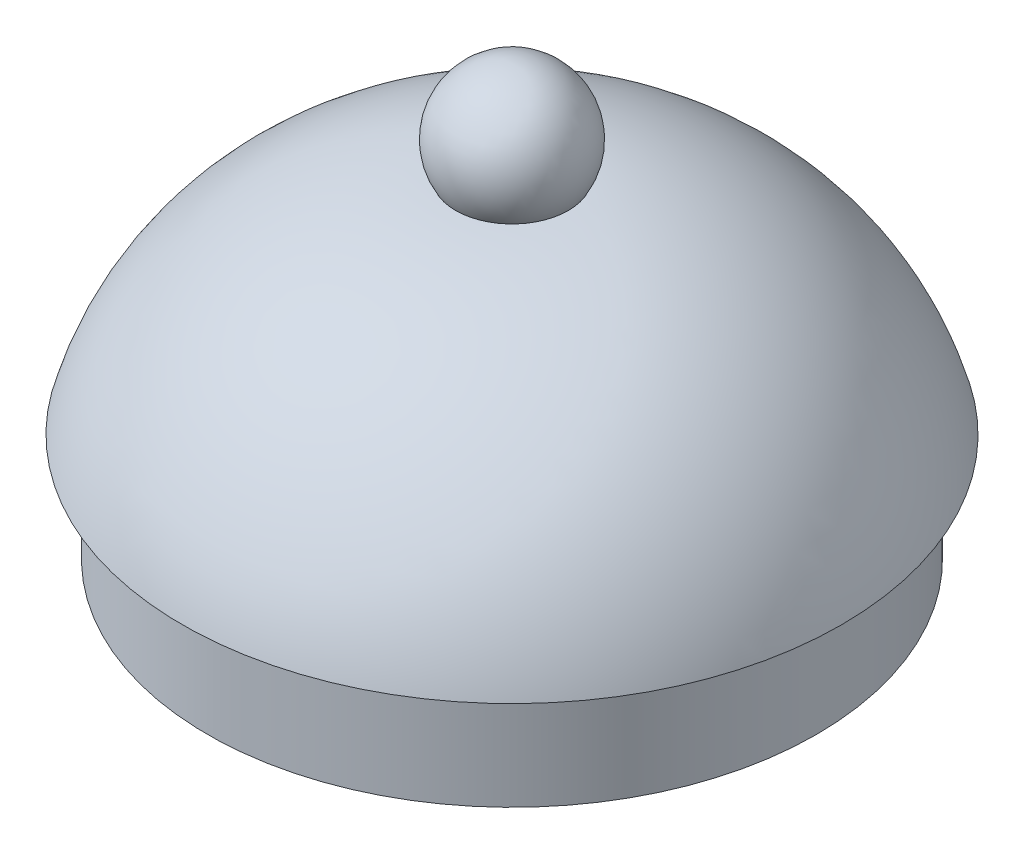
ISO-10303-21;
HEADER;
FILE_DESCRIPTION(('STEP AP214'),'2;1');
FILE_NAME('part.step','',(''),(''),'','','');
FILE_SCHEMA(('AUTOMOTIVE_DESIGN { 1 0 10303 214 1 1 1 1 }'));
ENDSEC;
DATA;
#1=APPLICATION_CONTEXT('core data for automotive mechanical design processes');
#2=APPLICATION_PROTOCOL_DEFINITION('international standard','automotive_design',2000,#1);
#3=PRODUCT_CONTEXT('',#1,'mechanical');
#4=PRODUCT('Part','Part','',(#3));
#5=PRODUCT_RELATED_PRODUCT_CATEGORY('part','',(#4));
#6=PRODUCT_DEFINITION_FORMATION('','',#4);
#7=PRODUCT_DEFINITION_CONTEXT('part definition',#1,'design');
#8=PRODUCT_DEFINITION('design','',#6,#7);
#9=PRODUCT_DEFINITION_SHAPE('','',#8);
#10=(LENGTH_UNIT() NAMED_UNIT(*) SI_UNIT(.MILLI.,.METRE.));
#11=(NAMED_UNIT(*) PLANE_ANGLE_UNIT() SI_UNIT($,.RADIAN.));
#12=(NAMED_UNIT(*) SI_UNIT($,.STERADIAN.) SOLID_ANGLE_UNIT());
#13=UNCERTAINTY_MEASURE_WITH_UNIT(LENGTH_MEASURE(1.E-05),#10,'distance_accuracy_value','');
#14=(GEOMETRIC_REPRESENTATION_CONTEXT(3) GLOBAL_UNCERTAINTY_ASSIGNED_CONTEXT((#13)) GLOBAL_UNIT_ASSIGNED_CONTEXT((#10,
#11,#12)) REPRESENTATION_CONTEXT('',''));
#15=CARTESIAN_POINT('',(0.,0.,0.));
#16=DIRECTION('',(0.,0.,1.));
#17=DIRECTION('',(1.,0.,0.));
#18=AXIS2_PLACEMENT_3D('',#15,#16,#17);
#19=CARTESIAN_POINT('',(0.,24.0362954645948,0.));
#20=DIRECTION('',(0.,1.,0.));
#21=DIRECTION('',(-1.,0.,0.));
#22=AXIS2_PLACEMENT_3D('',#19,#20,#21);
#23=DEGENERATE_TOROIDAL_SURFACE('',#22,31.6467172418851,240.,.T.);
#24=CARTESIAN_POINT('',(0.,263.660572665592,0.));
#25=DIRECTION('',(0.,1.,0.));
#26=DIRECTION('',(-1.,0.,0.));
#27=AXIS2_PLACEMENT_3D('',#24,#25,#26);
#28=CIRCLE('',#27,45.0707917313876);
#29=CARTESIAN_POINT('',(-45.0707917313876,263.660572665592,0.));
#30=VERTEX_POINT('',#29);
#31=EDGE_CURVE('E51',#30,#30,#28,.T.);
#32=ORIENTED_EDGE('',*,*,#31,.F.);
#33=EDGE_LOOP('',(#32));
#34=FACE_BOUND('',#33,.T.);
#35=CARTESIAN_POINT('',(0.,86.,0.));
#36=DIRECTION('',(0.,1.,0.));
#37=DIRECTION('',(-1.,0.,0.));
#38=AXIS2_PLACEMENT_3D('',#35,#36,#37);
#39=CIRCLE('',#38,263.50982194);
#40=CARTESIAN_POINT('',(-263.50982194,86.,0.));
#41=VERTEX_POINT('',#40);
#42=EDGE_CURVE('E78',#41,#41,#39,.T.);
#43=ORIENTED_EDGE('',*,*,#42,.T.);
#44=EDGE_LOOP('',(#43));
#45=FACE_BOUND('',#44,.T.);
#46=ADVANCED_FACE('F43',(#34,#45),#23,.T.);
#47=CARTESIAN_POINT('',(0.,0.,0.));
#48=DIRECTION('',(0.,1.,0.));
#49=DIRECTION('',(-1.,0.,0.));
#50=AXIS2_PLACEMENT_3D('',#47,#48,#49);
#51=PLANE('',#50);
#52=CARTESIAN_POINT('',(0.,0.,0.));
#53=DIRECTION('',(0.,1.,0.));
#54=DIRECTION('',(-1.,0.,0.));
#55=AXIS2_PLACEMENT_3D('',#52,#53,#54);
#56=CIRCLE('',#55,243.44982194);
#57=CARTESIAN_POINT('',(-243.44982194,0.,0.));
#58=VERTEX_POINT('',#57);
#59=EDGE_CURVE('E86',#58,#58,#56,.T.);
#60=ORIENTED_EDGE('',*,*,#59,.F.);
#61=EDGE_LOOP('',(#60));
#62=FACE_BOUND('',#61,.T.);
#63=ADVANCED_FACE('F66',(#62),#51,.F.);
#64=CARTESIAN_POINT('',(0.,261.940657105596,0.));
#65=DIRECTION('',(0.,1.,0.));
#66=DIRECTION('',(-1.,0.,0.));
#67=AXIS2_PLACEMENT_3D('',#64,#65,#66);
#68=CYLINDRICAL_SURFACE('',#67,243.44982194);
#69=CARTESIAN_POINT('',(0.,86.,0.));
#70=DIRECTION('',(0.,1.,0.));
#71=DIRECTION('',(-1.,0.,0.));
#72=AXIS2_PLACEMENT_3D('',#69,#70,#71);
#73=CIRCLE('',#72,243.44982194);
#74=CARTESIAN_POINT('',(-243.44982194,86.,0.));
#75=VERTEX_POINT('',#74);
#76=EDGE_CURVE('E81',#75,#75,#73,.T.);
#77=ORIENTED_EDGE('',*,*,#76,.F.);
#78=EDGE_LOOP('',(#77));
#79=FACE_BOUND('',#78,.T.);
#80=ORIENTED_EDGE('',*,*,#59,.T.);
#81=EDGE_LOOP('',(#80));
#82=FACE_BOUND('',#81,.T.);
#83=ADVANCED_FACE('F71',(#79,#82),#68,.T.);
#84=CARTESIAN_POINT('',(0.,86.,0.));
#85=DIRECTION('',(0.,-1.,0.));
#86=DIRECTION('',(1.,0.,0.));
#87=AXIS2_PLACEMENT_3D('',#84,#85,#86);
#88=PLANE('',#87);
#89=ORIENTED_EDGE('',*,*,#76,.T.);
#90=EDGE_LOOP('',(#89));
#91=FACE_BOUND('',#90,.T.);
#92=ORIENTED_EDGE('',*,*,#42,.F.);
#93=EDGE_LOOP('',(#92));
#94=FACE_BOUND('',#93,.T.);
#95=ADVANCED_FACE('F94',(#91,#94),#88,.T.);
#96=CARTESIAN_POINT('',(0.,290.413228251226,0.));
#97=DIRECTION('',(0.,-1.,0.));
#98=DIRECTION('',(1.,0.,0.));
#99=AXIS2_PLACEMENT_3D('',#96,#97,#98);
#100=SPHERICAL_SURFACE('',#99,52.4126019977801);
#101=ORIENTED_EDGE('',*,*,#31,.T.);
#102=EDGE_LOOP('',(#101));
#103=FACE_BOUND('',#102,.T.);
#104=ADVANCED_FACE('F92',(#103),#100,.T.);
#105=CLOSED_SHELL('',(#46,#63,#83,#95,#104));
#106=CARTESIAN_POINT('',(0.,263.660572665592,0.));
#107=DIRECTION('',(0.,-1.,0.));
#108=DIRECTION('',(0.,0.,-1.));
#109=AXIS2_PLACEMENT_3D('',#106,#107,#108);
#110=PLANE('',#109);
#111=CARTESIAN_POINT('',(0.,263.660572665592,0.));
#112=DIRECTION('',(0.,1.,0.));
#113=DIRECTION('',(0.,0.,1.));
#114=AXIS2_PLACEMENT_3D('',#111,#112,#113);
#115=CIRCLE('',#114,18.2226427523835);
#116=CARTESIAN_POINT('',(0.,263.660572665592,18.2226427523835));
#117=VERTEX_POINT('',#116);
#118=EDGE_CURVE('E11',#117,#117,#115,.F.);
#119=ORIENTED_EDGE('',*,*,#118,.T.);
#120=EDGE_LOOP('',(#119));
#121=FACE_BOUND('',#120,.T.);
#122=ADVANCED_FACE('F56',(#121),#110,.T.);
#123=CARTESIAN_POINT('',(-31.6467172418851,24.0362954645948,0.));
#124=DIRECTION('',(0.,0.,-1.));
#125=DIRECTION('',(-1.,0.,0.));
#126=AXIS2_PLACEMENT_3D('',#123,#124,#125);
#127=CIRCLE('',#126,240.);
#128=TRIMMED_CURVE('',#127,(PARAMETER_VALUE(-1.70304279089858)),
(PARAMETER_VALUE(1.70304279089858)),.T.,.PARAMETER.);
#129=CARTESIAN_POINT('',(0.,24.0362954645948,0.));
#130=DIRECTION('',(0.,1.,0.));
#131=AXIS1_PLACEMENT('',#129,#130);
#132=SURFACE_OF_REVOLUTION('',#128,#131);
#133=ORIENTED_EDGE('',*,*,#118,.F.);
#134=EDGE_LOOP('',(#133));
#135=FACE_BOUND('',#134,.T.);
#136=CARTESIAN_POINT('',(0.,261.940657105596,0.));
#137=VERTEX_POINT('',#136);
#138=VERTEX_LOOP('',#137);
#139=FACE_BOUND('',#138,.T.);
#140=ADVANCED_FACE('F54',(#135,#139),#132,.T.);
#141=CLOSED_SHELL('',(#122,#140));
#142=ORIENTED_CLOSED_SHELL('',*,#141,.T.);
#143=BREP_WITH_VOIDS('B2',#105,(#142));
#144=ADVANCED_BREP_SHAPE_REPRESENTATION('',(#18,#143),#14);
#145=SHAPE_DEFINITION_REPRESENTATION(#9,#144);
ENDSEC;
END-ISO-10303-21;
